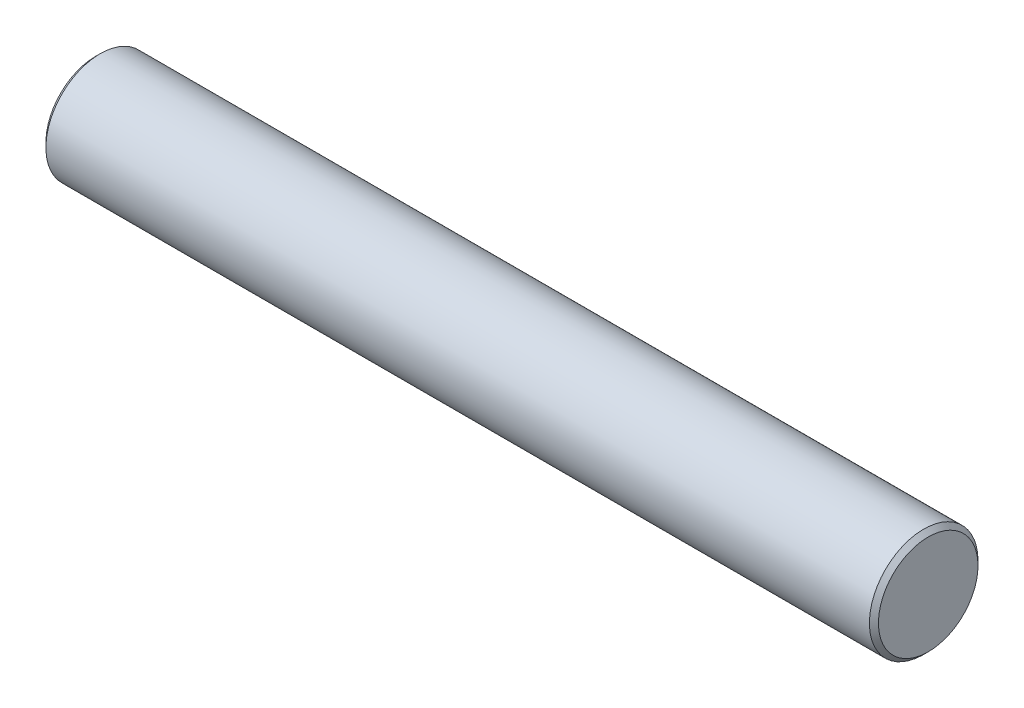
from build123d import *

# Parameters (mm, degrees)
SKETCH_1_R      = 3
EXTRUDE_1_DEPTH = 46
CHAMFER_1_SIZE  = 0.25


with BuildPart() as part:
    # Sketch 1 → Extrude 1 (new body)
    with BuildSketch(Plane(origin=(0, 0, 0), x_dir=(0, 0, -1), z_dir=(1, 0, 0))):
        Circle(SKETCH_1_R)
    extrude(amount=EXTRUDE_1_DEPTH)

    # Chamfer 1
    chamfer_1_edges = [part.edges().sort_by_distance(p)[0] for p in [
        (0, 0, 3),
        (46, 0, 3),
    ]]
    chamfer(chamfer_1_edges, length=CHAMFER_1_SIZE)


solid = part.part
